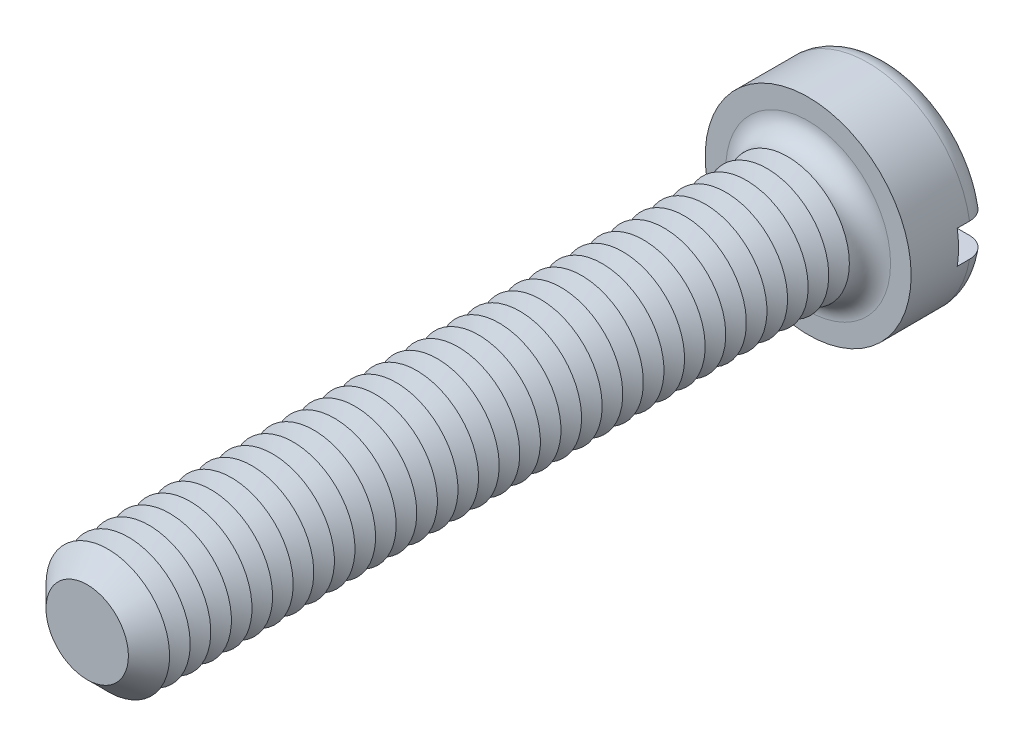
from build123d import *

# Parameters (mm, degrees)
SKETCH3_R           = 5
BOSS_EXTRUDE2_DEPTH = 3.9
SKETCH4_R           = 3
BOSS_EXTRUDE3_DEPTH = 35
FILLET1_R           = 1
CHAMFER1_SIZE       = 1
LPATTERN1_COUNT     = 33
LPATTERN1_PITCH     = 1
SKETCH8_W           = 10
SKETCH8_H           = 1.6
CUT_EXTRUDE1_DEPTH  = 1.6


with BuildPart() as part:
    # Sketch3 → Boss-Extrude2 (new body)
    with BuildSketch(Plane.XY):
        Circle(SKETCH3_R)
    extrude(amount=-BOSS_EXTRUDE2_DEPTH)

    # Sketch4 → Boss-Extrude3 (add)
    with BuildSketch(Plane.XY):
        Circle(SKETCH4_R)
    extrude(amount=BOSS_EXTRUDE3_DEPTH)

    # Fillet1
    fillet1_edges = [part.edges().sort_by_distance(p)[0] for p in [
        (-5, 0, -3.9),
        (-3, 0, 0),
    ]]
    fillet(fillet1_edges, radius=FILLET1_R)

    # Chamfer1
    chamfer1_edges = [part.edges().sort_by_distance(p)[0] for p in [
        (-3, 0, 35),
    ]]
    chamfer(chamfer1_edges, length=CHAMFER1_SIZE)

    # Sketch6 → Cut-Revolve1 (revolve, cut)
    with BuildSketch(Plane(origin=(0, 0, 0), x_dir=(0, 0, -1), z_dir=(1, 0, 0)), mode=Mode.PRIVATE) as cut_revolve1_sk:
        Polygon((-1, 3), (-1.5, 2.133974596), (-2, 3), align=None)
    cut_revolve1 = revolve(cut_revolve1_sk.sketch.rotate(Axis((0, 0, -1.694361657), (0, 0, 1)), 90), axis=Axis((0, 0, -1.694361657), (0, 0, 1)), mode=Mode.SUBTRACT)

    # LPattern1: Cut-Revolve1 ×33
    with Locations(*[(0, 0, i * LPATTERN1_PITCH) for i in range(1, LPATTERN1_COUNT)]):
        add(cut_revolve1, mode=Mode.SUBTRACT)

    # Sketch8 → Cut-Extrude1 (cut)
    with BuildSketch(Plane(origin=(0, 0, -3.9), x_dir=(-1, 0, 0), z_dir=(0, 0, -1))):
        Rectangle(SKETCH8_W, SKETCH8_H)
    extrude(amount=-CUT_EXTRUDE1_DEPTH, mode=Mode.SUBTRACT)


solid = part.part
